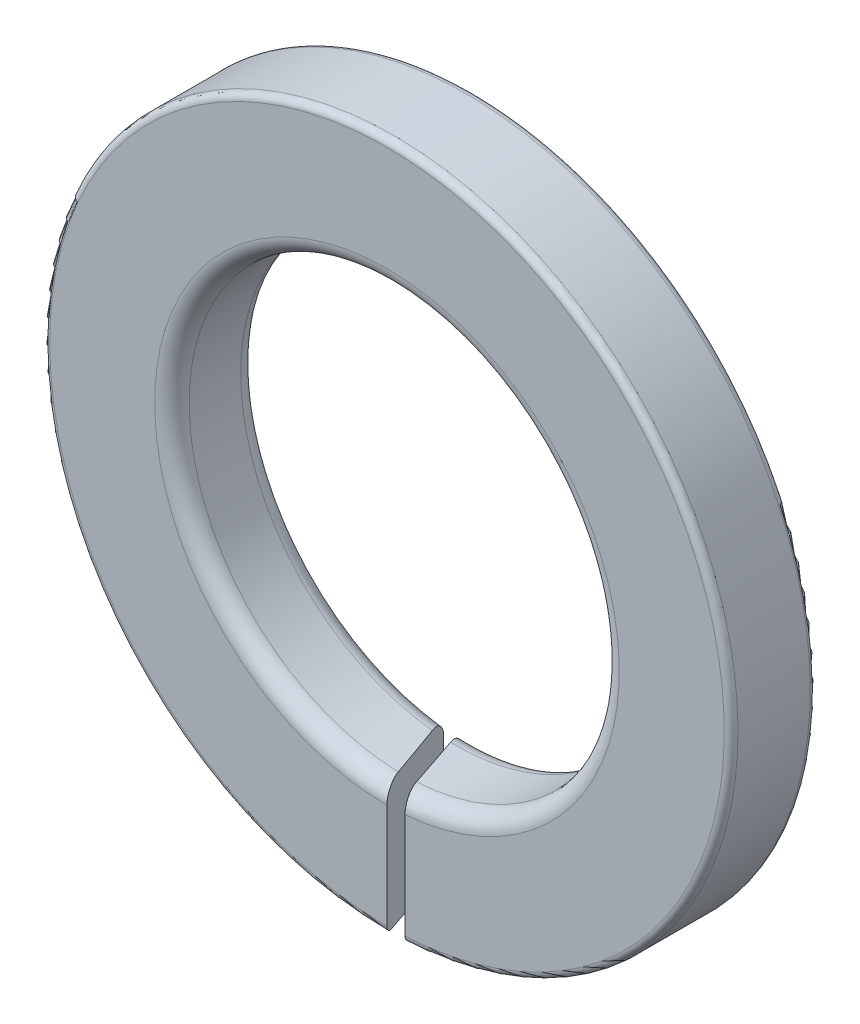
from build123d import *

# Parameters (mm, degrees)
ESQUISSE1_R             = 10
ESQUISSE1_R_2           = 6.25
EXTRUSION1_DEPTH        = 2.5
ENL_V_MAT_EXTRU_1_DEPTH = 15.361406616
CONG_1_R                = 0.5
CONG_2_R                = 0.2


with BuildPart() as part:
    # Esquisse1 → Extrusion1 (new body)
    with BuildSketch(Plane.XY):
        Circle(ESQUISSE1_R)
        Circle(ESQUISSE1_R_2, mode=Mode.SUBTRACT)
    extrude(amount=EXTRUSION1_DEPTH)

    # Esquisse2 → Enl_v. mat.-Extru.1 (cut, through all)
    with BuildSketch(Plane(origin=(0, 0, 0), x_dir=(1, 0, 0), z_dir=(0, 1, 0))):
        Polygon((-0.851663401, 0), (0, -2.5), (0.524617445, -2.5), (-0.327045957, 0), align=None)
    extrude(amount=-ENL_V_MAT_EXTRU_1_DEPTH, mode=Mode.SUBTRACT)

    # Cong_1
    cong_1_edges = [part.edges().sort_by_distance(p)[0] for p in [
        (-4.419417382, 4.419417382, 2.5),
        (-4.107286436, 4.710912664, 0),
    ]]
    fillet(cong_1_edges, radius=CONG_1_R)

    # Cong_2
    cong_2_edges = [part.edges().sort_by_distance(p)[0] for p in [
        (-7.071067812, 7.071067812, 2.5),
        (-6.76325979, 7.366024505, 0),
    ]]
    fillet(cong_2_edges, radius=CONG_2_R)


solid = part.part
